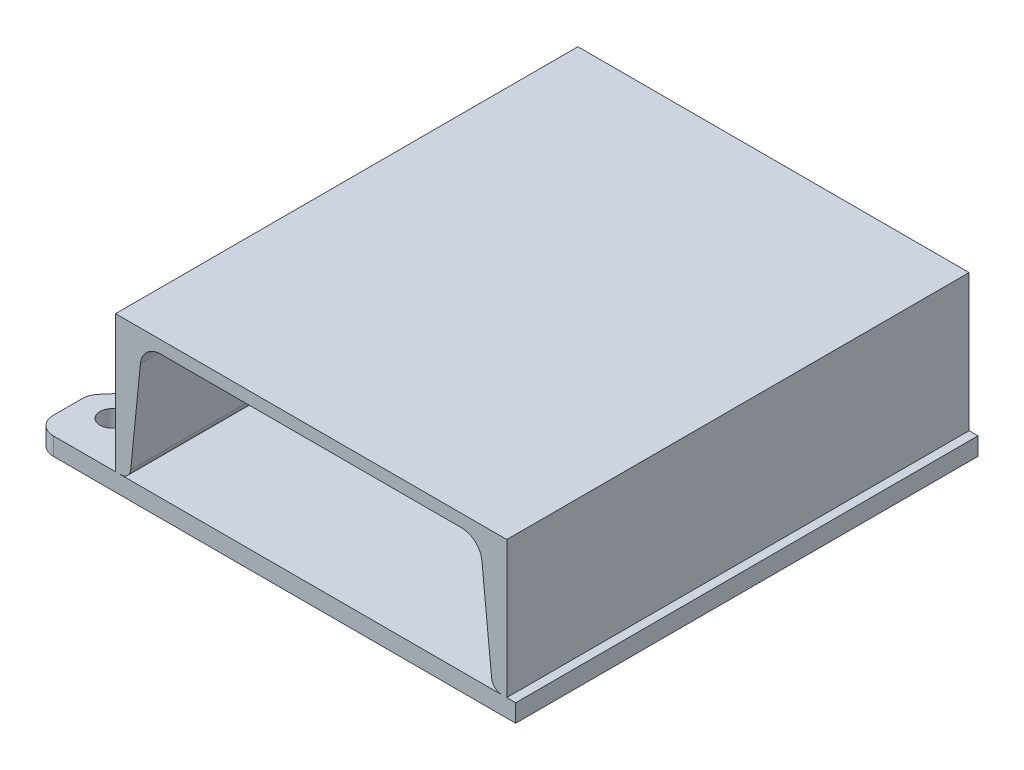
ISO-10303-21;
HEADER;
FILE_DESCRIPTION(('STEP AP214'),'2;1');
FILE_NAME('part.step','',(''),(''),'','','');
FILE_SCHEMA(('AUTOMOTIVE_DESIGN { 1 0 10303 214 1 1 1 1 }'));
ENDSEC;
DATA;
#1=APPLICATION_CONTEXT('core data for automotive mechanical design processes');
#2=APPLICATION_PROTOCOL_DEFINITION('international standard','automotive_design',2000,#1);
#3=PRODUCT_CONTEXT('',#1,'mechanical');
#4=PRODUCT('Part','Part','',(#3));
#5=PRODUCT_RELATED_PRODUCT_CATEGORY('part','',(#4));
#6=PRODUCT_DEFINITION_FORMATION('','',#4);
#7=PRODUCT_DEFINITION_CONTEXT('part definition',#1,'design');
#8=PRODUCT_DEFINITION('design','',#6,#7);
#9=PRODUCT_DEFINITION_SHAPE('','',#8);
#10=(LENGTH_UNIT() NAMED_UNIT(*) SI_UNIT(.MILLI.,.METRE.));
#11=(NAMED_UNIT(*) PLANE_ANGLE_UNIT() SI_UNIT($,.RADIAN.));
#12=(NAMED_UNIT(*) SI_UNIT($,.STERADIAN.) SOLID_ANGLE_UNIT());
#13=UNCERTAINTY_MEASURE_WITH_UNIT(LENGTH_MEASURE(1.E-05),#10,'distance_accuracy_value','');
#14=(GEOMETRIC_REPRESENTATION_CONTEXT(3) GLOBAL_UNCERTAINTY_ASSIGNED_CONTEXT((#13)) GLOBAL_UNIT_ASSIGNED_CONTEXT((#10,
#11,#12)) REPRESENTATION_CONTEXT('',''));
#15=CARTESIAN_POINT('',(0.,0.,0.));
#16=DIRECTION('',(0.,0.,1.));
#17=DIRECTION('',(1.,0.,0.));
#18=AXIS2_PLACEMENT_3D('',#15,#16,#17);
#19=CARTESIAN_POINT('',(-270.,10.,-130.));
#20=DIRECTION('',(0.,1.,0.));
#21=DIRECTION('',(0.,0.,1.));
#22=AXIS2_PLACEMENT_3D('',#19,#20,#21);
#23=PLANE('',#22);
#24=CARTESIAN_POINT('',(-252.,10.,105.));
#25=DIRECTION('',(0.,1.,0.));
#26=DIRECTION('',(0.,0.,1.));
#27=AXIS2_PLACEMENT_3D('',#24,#25,#26);
#28=CIRCLE('',#27,6.75);
#29=CARTESIAN_POINT('',(-252.,10.,111.75));
#30=VERTEX_POINT('',#29);
#31=EDGE_CURVE('E416',#30,#30,#28,.T.);
#32=ORIENTED_EDGE('',*,*,#31,.F.);
#33=EDGE_LOOP('',(#32));
#34=FACE_BOUND('',#33,.T.);
#35=CARTESIAN_POINT('',(-252.,10.,-105.));
#36=DIRECTION('',(0.,1.,0.));
#37=DIRECTION('',(0.,0.,1.));
#38=AXIS2_PLACEMENT_3D('',#35,#36,#37);
#39=CIRCLE('',#38,6.75);
#40=CARTESIAN_POINT('',(-252.,10.,-98.25));
#41=VERTEX_POINT('',#40);
#42=EDGE_CURVE('E250',#41,#41,#39,.T.);
#43=ORIENTED_EDGE('',*,*,#42,.F.);
#44=EDGE_LOOP('',(#43));
#45=FACE_BOUND('',#44,.T.);
#46=DIRECTION('',(1.,0.,0.));
#47=VECTOR('',#46,1.);
#48=CARTESIAN_POINT('',(0.,10.,130.));
#49=LINE('',#48,#47);
#50=CARTESIAN_POINT('',(-260.,10.,130.));
#51=VERTEX_POINT('',#50);
#52=CARTESIAN_POINT('',(-225.,10.,130.));
#53=VERTEX_POINT('',#52);
#54=EDGE_CURVE('E204',#51,#53,#49,.T.);
#55=ORIENTED_EDGE('',*,*,#54,.T.);
#56=DIRECTION('',(0.,0.,1.));
#57=VECTOR('',#56,1.);
#58=CARTESIAN_POINT('',(-225.,10.,-130.));
#59=LINE('',#58,#57);
#60=CARTESIAN_POINT('',(-225.,10.,-130.));
#61=VERTEX_POINT('',#60);
#62=EDGE_CURVE('E192',#61,#53,#59,.T.);
#63=ORIENTED_EDGE('',*,*,#62,.F.);
#64=DIRECTION('',(-1.,0.,0.));
#65=VECTOR('',#64,1.);
#66=CARTESIAN_POINT('',(0.,10.,-130.));
#67=LINE('',#66,#65);
#68=CARTESIAN_POINT('',(-260.,10.,-130.));
#69=VERTEX_POINT('',#68);
#70=EDGE_CURVE('E202',#61,#69,#67,.T.);
#71=ORIENTED_EDGE('',*,*,#70,.T.);
#72=CARTESIAN_POINT('',(-260.,10.,-120.));
#73=DIRECTION('',(0.,1.,0.));
#74=DIRECTION('',(0.,0.,1.));
#75=AXIS2_PLACEMENT_3D('',#72,#73,#74);
#76=CIRCLE('',#75,10.);
#77=CARTESIAN_POINT('',(-270.,10.,-120.));
#78=VERTEX_POINT('',#77);
#79=EDGE_CURVE('E290',#69,#78,#76,.T.);
#80=ORIENTED_EDGE('',*,*,#79,.T.);
#81=DIRECTION('',(0.,0.,1.));
#82=VECTOR('',#81,1.);
#83=CARTESIAN_POINT('',(-270.,10.,-130.));
#84=LINE('',#83,#82);
#85=CARTESIAN_POINT('',(-270.,10.,-103.699240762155));
#86=VERTEX_POINT('',#85);
#87=EDGE_CURVE('E222',#78,#86,#84,.T.);
#88=ORIENTED_EDGE('',*,*,#87,.T.);
#89=CARTESIAN_POINT('',(-260.,10.,-103.699240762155));
#90=DIRECTION('',(0.,1.,0.));
#91=DIRECTION('',(0.,0.,1.));
#92=AXIS2_PLACEMENT_3D('',#89,#90,#91);
#93=CIRCLE('',#92,10.);
#94=CARTESIAN_POINT('',(-267.592566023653,10.,-97.1913270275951));
#95=VERTEX_POINT('',#94);
#96=EDGE_CURVE('E288',#86,#95,#93,.T.);
#97=ORIENTED_EDGE('',*,*,#96,.T.);
#98=DIRECTION('',(0.650791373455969,0.,0.759256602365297));
#99=VECTOR('',#98,1.);
#100=CARTESIAN_POINT('',(-270.,10.,-100.));
#101=LINE('',#100,#99);
#102=CARTESIAN_POINT('',(-242.407433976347,10.,-67.8086729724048));
#103=VERTEX_POINT('',#102);
#104=EDGE_CURVE('E227',#95,#103,#101,.T.);
#105=ORIENTED_EDGE('',*,*,#104,.T.);
#106=CARTESIAN_POINT('',(-250.,10.,-61.3007592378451));
#107=DIRECTION('',(0.,1.,0.));
#108=DIRECTION('',(0.,0.,1.));
#109=AXIS2_PLACEMENT_3D('',#106,#107,#108);
#110=CIRCLE('',#109,10.);
#111=CARTESIAN_POINT('',(-240.,10.,-61.3007592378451));
#112=VERTEX_POINT('',#111);
#113=EDGE_CURVE('E317',#103,#112,#110,.F.);
#114=ORIENTED_EDGE('',*,*,#113,.T.);
#115=DIRECTION('',(0.,0.,1.));
#116=VECTOR('',#115,1.);
#117=CARTESIAN_POINT('',(-240.,10.,-65.));
#118=LINE('',#117,#116);
#119=CARTESIAN_POINT('',(-240.,10.,61.3007592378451));
#120=VERTEX_POINT('',#119);
#121=EDGE_CURVE('E231',#112,#120,#118,.T.);
#122=ORIENTED_EDGE('',*,*,#121,.T.);
#123=CARTESIAN_POINT('',(-250.,10.,61.3007592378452));
#124=DIRECTION('',(0.,1.,0.));
#125=DIRECTION('',(0.,0.,1.));
#126=AXIS2_PLACEMENT_3D('',#123,#124,#125);
#127=CIRCLE('',#126,10.);
#128=CARTESIAN_POINT('',(-242.407433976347,10.,67.8086729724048));
#129=VERTEX_POINT('',#128);
#130=EDGE_CURVE('E10',#120,#129,#127,.F.);
#131=ORIENTED_EDGE('',*,*,#130,.T.);
#132=DIRECTION('',(-0.650791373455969,0.,0.759256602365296));
#133=VECTOR('',#132,1.);
#134=CARTESIAN_POINT('',(-270.,10.,100.));
#135=LINE('',#134,#133);
#136=CARTESIAN_POINT('',(-267.592566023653,10.,97.1913270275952));
#137=VERTEX_POINT('',#136);
#138=EDGE_CURVE('E236',#129,#137,#135,.T.);
#139=ORIENTED_EDGE('',*,*,#138,.T.);
#140=CARTESIAN_POINT('',(-260.,10.,103.699240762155));
#141=DIRECTION('',(0.,1.,0.));
#142=DIRECTION('',(0.,0.,1.));
#143=AXIS2_PLACEMENT_3D('',#140,#141,#142);
#144=CIRCLE('',#143,10.);
#145=CARTESIAN_POINT('',(-270.,10.,103.699240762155));
#146=VERTEX_POINT('',#145);
#147=EDGE_CURVE('E286',#137,#146,#144,.T.);
#148=ORIENTED_EDGE('',*,*,#147,.T.);
#149=DIRECTION('',(0.,0.,1.));
#150=VECTOR('',#149,1.);
#151=CARTESIAN_POINT('',(-270.,10.,130.));
#152=LINE('',#151,#150);
#153=CARTESIAN_POINT('',(-270.,10.,120.));
#154=VERTEX_POINT('',#153);
#155=EDGE_CURVE('E239',#146,#154,#152,.T.);
#156=ORIENTED_EDGE('',*,*,#155,.T.);
#157=CARTESIAN_POINT('',(-260.,10.,120.));
#158=DIRECTION('',(0.,1.,0.));
#159=DIRECTION('',(0.,0.,1.));
#160=AXIS2_PLACEMENT_3D('',#157,#158,#159);
#161=CIRCLE('',#160,10.);
#162=EDGE_CURVE('E38',#154,#51,#161,.T.);
#163=ORIENTED_EDGE('',*,*,#162,.T.);
#164=EDGE_LOOP('',(#55,#63,#71,#80,#88,#97,#105,#114,#122,#131,#139,#148,#156,#163));
#165=FACE_BOUND('',#164,.T.);
#166=ADVANCED_FACE('F15',(#34,#45,#165),#23,.T.);
#167=CARTESIAN_POINT('',(0.,10.,-130.));
#168=VERTEX_POINT('',#167);
#169=CARTESIAN_POINT('',(-5.,10.,-130.));
#170=VERTEX_POINT('',#169);
#171=EDGE_CURVE('E215',#168,#170,#67,.T.);
#172=ORIENTED_EDGE('',*,*,#171,.T.);
#173=DIRECTION('',(0.,0.,1.));
#174=VECTOR('',#173,1.);
#175=CARTESIAN_POINT('',(-5.,10.,-130.));
#176=LINE('',#175,#174);
#177=CARTESIAN_POINT('',(-5.,10.,130.));
#178=VERTEX_POINT('',#177);
#179=EDGE_CURVE('E365',#170,#178,#176,.T.);
#180=ORIENTED_EDGE('',*,*,#179,.T.);
#181=CARTESIAN_POINT('',(0.,10.,130.));
#182=VERTEX_POINT('',#181);
#183=EDGE_CURVE('E241',#178,#182,#49,.T.);
#184=ORIENTED_EDGE('',*,*,#183,.T.);
#185=DIRECTION('',(0.,0.,-1.));
#186=VECTOR('',#185,1.);
#187=CARTESIAN_POINT('',(0.,10.,130.));
#188=LINE('',#187,#186);
#189=EDGE_CURVE('E243',#182,#168,#188,.T.);
#190=ORIENTED_EDGE('',*,*,#189,.T.);
#191=EDGE_LOOP('',(#172,#180,#184,#190));
#192=FACE_BOUND('',#191,.T.);
#193=ADVANCED_FACE('F428',(#192),#23,.T.);
#194=CARTESIAN_POINT('',(-7.7963215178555,10.,-130.));
#195=VERTEX_POINT('',#194);
#196=CARTESIAN_POINT('',(-222.203678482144,10.,-130.));
#197=VERTEX_POINT('',#196);
#198=EDGE_CURVE('E212',#195,#197,#67,.T.);
#199=ORIENTED_EDGE('',*,*,#198,.T.);
#200=DIRECTION('',(0.,0.,1.));
#201=VECTOR('',#200,1.);
#202=CARTESIAN_POINT('',(-222.203678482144,10.,-130.));
#203=LINE('',#202,#201);
#204=CARTESIAN_POINT('',(-222.203678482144,10.,130.));
#205=VERTEX_POINT('',#204);
#206=EDGE_CURVE('E396',#197,#205,#203,.T.);
#207=ORIENTED_EDGE('',*,*,#206,.T.);
#208=CARTESIAN_POINT('',(-7.7963215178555,10.,130.));
#209=VERTEX_POINT('',#208);
#210=EDGE_CURVE('E244',#205,#209,#49,.T.);
#211=ORIENTED_EDGE('',*,*,#210,.T.);
#212=DIRECTION('',(0.,0.,1.));
#213=VECTOR('',#212,1.);
#214=CARTESIAN_POINT('',(-7.7963215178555,10.,-130.));
#215=LINE('',#214,#213);
#216=EDGE_CURVE('E410',#209,#195,#215,.F.);
#217=ORIENTED_EDGE('',*,*,#216,.T.);
#218=EDGE_LOOP('',(#199,#207,#211,#217));
#219=FACE_BOUND('',#218,.T.);
#220=ADVANCED_FACE('F431',(#219),#23,.T.);
#221=CARTESIAN_POINT('',(0.,10.,-130.));
#222=DIRECTION('',(0.,0.,1.));
#223=DIRECTION('',(1.,0.,0.));
#224=AXIS2_PLACEMENT_3D('',#221,#222,#223);
#225=PLANE('',#224);
#226=ORIENTED_EDGE('',*,*,#198,.F.);
#227=CARTESIAN_POINT('',(-7.7963215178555,15.75,-130.));
#228=DIRECTION('',(0.,0.,-1.));
#229=DIRECTION('',(0.,1.,0.));
#230=AXIS2_PLACEMENT_3D('',#227,#228,#229);
#231=CIRCLE('',#230,5.75);
#232=CARTESIAN_POINT('',(-13.5177853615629,15.1778536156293,-130.));
#233=VERTEX_POINT('',#232);
#234=EDGE_CURVE('E403',#195,#233,#231,.T.);
#235=ORIENTED_EDGE('',*,*,#234,.T.);
#236=DIRECTION('',(-0.0995037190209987,0.995037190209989,0.));
#237=VECTOR('',#236,1.);
#238=CARTESIAN_POINT('',(-20.,80.,-130.));
#239=LINE('',#238,#237);
#240=CARTESIAN_POINT('',(-18.9644292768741,69.6442927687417,-130.));
#241=VERTEX_POINT('',#240);
#242=EDGE_CURVE('E655',#233,#241,#239,.T.);
#243=ORIENTED_EDGE('',*,*,#242,.T.);
#244=CARTESIAN_POINT('',(-30.4073569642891,68.5,-130.));
#245=DIRECTION('',(0.,0.,-1.));
#246=DIRECTION('',(0.,1.,0.));
#247=AXIS2_PLACEMENT_3D('',#244,#245,#246);
#248=CIRCLE('',#247,11.5);
#249=CARTESIAN_POINT('',(-30.4073569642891,80.,-130.));
#250=VERTEX_POINT('',#249);
#251=EDGE_CURVE('E394',#241,#250,#248,.F.);
#252=ORIENTED_EDGE('',*,*,#251,.T.);
#253=DIRECTION('',(-1.,0.,0.));
#254=VECTOR('',#253,1.);
#255=CARTESIAN_POINT('',(-210.,80.,-130.));
#256=LINE('',#255,#254);
#257=CARTESIAN_POINT('',(-199.592643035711,80.,-130.));
#258=VERTEX_POINT('',#257);
#259=EDGE_CURVE('E660',#250,#258,#256,.T.);
#260=ORIENTED_EDGE('',*,*,#259,.T.);
#261=CARTESIAN_POINT('',(-199.592643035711,68.5,-130.));
#262=DIRECTION('',(0.,0.,-1.));
#263=DIRECTION('',(0.,1.,0.));
#264=AXIS2_PLACEMENT_3D('',#261,#262,#263);
#265=CIRCLE('',#264,11.5);
#266=CARTESIAN_POINT('',(-211.035570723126,69.6442927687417,-130.));
#267=VERTEX_POINT('',#266);
#268=EDGE_CURVE('E389',#258,#267,#265,.F.);
#269=ORIENTED_EDGE('',*,*,#268,.T.);
#270=DIRECTION('',(-0.0995037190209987,-0.995037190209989,0.));
#271=VECTOR('',#270,1.);
#272=CARTESIAN_POINT('',(-210.,80.,-130.));
#273=LINE('',#272,#271);
#274=CARTESIAN_POINT('',(-216.482214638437,15.1778536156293,-130.));
#275=VERTEX_POINT('',#274);
#276=EDGE_CURVE('E200',#267,#275,#273,.T.);
#277=ORIENTED_EDGE('',*,*,#276,.T.);
#278=CARTESIAN_POINT('',(-222.203678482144,15.75,-130.));
#279=DIRECTION('',(0.,0.,-1.));
#280=DIRECTION('',(0.,1.,0.));
#281=AXIS2_PLACEMENT_3D('',#278,#279,#280);
#282=CIRCLE('',#281,5.75);
#283=EDGE_CURVE('E405',#275,#197,#282,.T.);
#284=ORIENTED_EDGE('',*,*,#283,.T.);
#285=EDGE_LOOP('',(#226,#235,#243,#252,#260,#269,#277,#284));
#286=FACE_BOUND('',#285,.T.);
#287=DIRECTION('',(-1.,0.,0.));
#288=VECTOR('',#287,1.);
#289=CARTESIAN_POINT('',(0.,0.,-130.));
#290=LINE('',#289,#288);
#291=CARTESIAN_POINT('',(0.,0.,-130.));
#292=VERTEX_POINT('',#291);
#293=CARTESIAN_POINT('',(-260.,0.,-130.));
#294=VERTEX_POINT('',#293);
#295=EDGE_CURVE('E247',#292,#294,#290,.T.);
#296=ORIENTED_EDGE('',*,*,#295,.T.);
#297=DIRECTION('',(0.,-1.,0.));
#298=VECTOR('',#297,1.);
#299=CARTESIAN_POINT('',(-260.,10.,-130.));
#300=LINE('',#299,#298);
#301=EDGE_CURVE('E210',#294,#69,#300,.F.);
#302=ORIENTED_EDGE('',*,*,#301,.T.);
#303=ORIENTED_EDGE('',*,*,#70,.F.);
#304=DIRECTION('',(0.,1.,0.));
#305=VECTOR('',#304,1.);
#306=CARTESIAN_POINT('',(-225.,87.,-130.));
#307=LINE('',#306,#305);
#308=CARTESIAN_POINT('',(-225.,87.,-130.));
#309=VERTEX_POINT('',#308);
#310=EDGE_CURVE('E189',#61,#309,#307,.T.);
#311=ORIENTED_EDGE('',*,*,#310,.T.);
#312=DIRECTION('',(1.,0.,0.));
#313=VECTOR('',#312,1.);
#314=CARTESIAN_POINT('',(-5.,87.,-130.));
#315=LINE('',#314,#313);
#316=CARTESIAN_POINT('',(-5.,87.,-130.));
#317=VERTEX_POINT('',#316);
#318=EDGE_CURVE('E199',#309,#317,#315,.T.);
#319=ORIENTED_EDGE('',*,*,#318,.T.);
#320=DIRECTION('',(0.,-1.,0.));
#321=VECTOR('',#320,1.);
#322=CARTESIAN_POINT('',(-5.,87.,-130.));
#323=LINE('',#322,#321);
#324=EDGE_CURVE('E360',#317,#170,#323,.T.);
#325=ORIENTED_EDGE('',*,*,#324,.T.);
#326=ORIENTED_EDGE('',*,*,#171,.F.);
#327=DIRECTION('',(0.,-1.,0.));
#328=VECTOR('',#327,1.);
#329=CARTESIAN_POINT('',(0.,10.,-130.));
#330=LINE('',#329,#328);
#331=EDGE_CURVE('E246',#168,#292,#330,.T.);
#332=ORIENTED_EDGE('',*,*,#331,.T.);
#333=EDGE_LOOP('',(#296,#302,#303,#311,#319,#325,#326,#332));
#334=FACE_BOUND('',#333,.T.);
#335=ADVANCED_FACE('F208',(#286,#334),#225,.F.);
#336=CARTESIAN_POINT('',(-270.,10.,-130.));
#337=DIRECTION('',(1.,0.,0.));
#338=DIRECTION('',(0.,0.,-1.));
#339=AXIS2_PLACEMENT_3D('',#336,#337,#338);
#340=PLANE('',#339);
#341=ORIENTED_EDGE('',*,*,#87,.F.);
#342=DIRECTION('',(0.,-1.,0.));
#343=VECTOR('',#342,1.);
#344=CARTESIAN_POINT('',(-270.,10.,-120.));
#345=LINE('',#344,#343);
#346=CARTESIAN_POINT('',(-270.,0.,-120.));
#347=VERTEX_POINT('',#346);
#348=EDGE_CURVE('E273',#78,#347,#345,.T.);
#349=ORIENTED_EDGE('',*,*,#348,.T.);
#350=DIRECTION('',(0.,0.,1.));
#351=VECTOR('',#350,1.);
#352=CARTESIAN_POINT('',(-270.,0.,-130.));
#353=LINE('',#352,#351);
#354=CARTESIAN_POINT('',(-270.,0.,-103.699240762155));
#355=VERTEX_POINT('',#354);
#356=EDGE_CURVE('E249',#347,#355,#353,.T.);
#357=ORIENTED_EDGE('',*,*,#356,.T.);
#358=DIRECTION('',(0.,-1.,0.));
#359=VECTOR('',#358,1.);
#360=CARTESIAN_POINT('',(-270.,10.,-103.699240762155));
#361=LINE('',#360,#359);
#362=EDGE_CURVE('E271',#355,#86,#361,.F.);
#363=ORIENTED_EDGE('',*,*,#362,.T.);
#364=EDGE_LOOP('',(#341,#349,#357,#363));
#365=FACE_BOUND('',#364,.T.);
#366=ADVANCED_FACE('F446',(#365),#340,.F.);
#367=CARTESIAN_POINT('',(-270.,10.,-100.));
#368=DIRECTION('',(0.759256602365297,0.,-0.650791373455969));
#369=DIRECTION('',(-0.650791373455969,0.,-0.759256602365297));
#370=AXIS2_PLACEMENT_3D('',#367,#368,#369);
#371=PLANE('',#370);
#372=ORIENTED_EDGE('',*,*,#104,.F.);
#373=DIRECTION('',(0.,-1.,0.));
#374=VECTOR('',#373,1.);
#375=CARTESIAN_POINT('',(-267.592566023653,10.,-97.1913270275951));
#376=LINE('',#375,#374);
#377=CARTESIAN_POINT('',(-267.592566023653,0.,-97.1913270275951));
#378=VERTEX_POINT('',#377);
#379=EDGE_CURVE('E294',#95,#378,#376,.T.);
#380=ORIENTED_EDGE('',*,*,#379,.T.);
#381=DIRECTION('',(0.650791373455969,0.,0.759256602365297));
#382=VECTOR('',#381,1.);
#383=CARTESIAN_POINT('',(-270.,0.,-100.));
#384=LINE('',#383,#382);
#385=CARTESIAN_POINT('',(-242.407433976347,0.,-67.8086729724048));
#386=VERTEX_POINT('',#385);
#387=EDGE_CURVE('E253',#378,#386,#384,.T.);
#388=ORIENTED_EDGE('',*,*,#387,.T.);
#389=DIRECTION('',(0.,-1.,0.));
#390=VECTOR('',#389,1.);
#391=CARTESIAN_POINT('',(-242.407433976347,10.,-67.8086729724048));
#392=LINE('',#391,#390);
#393=EDGE_CURVE('E292',#386,#103,#392,.F.);
#394=ORIENTED_EDGE('',*,*,#393,.T.);
#395=EDGE_LOOP('',(#372,#380,#388,#394));
#396=FACE_BOUND('',#395,.T.);
#397=ADVANCED_FACE('F507',(#396),#371,.F.);
#398=CARTESIAN_POINT('',(-240.,10.,-65.));
#399=DIRECTION('',(1.,0.,0.));
#400=DIRECTION('',(0.,0.,-1.));
#401=AXIS2_PLACEMENT_3D('',#398,#399,#400);
#402=PLANE('',#401);
#403=ORIENTED_EDGE('',*,*,#121,.F.);
#404=DIRECTION('',(0.,-1.,0.));
#405=VECTOR('',#404,1.);
#406=CARTESIAN_POINT('',(-240.,0.,-61.3007592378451));
#407=LINE('',#406,#405);
#408=CARTESIAN_POINT('',(-240.,0.,-61.3007592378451));
#409=VERTEX_POINT('',#408);
#410=EDGE_CURVE('E299',#112,#409,#407,.T.);
#411=ORIENTED_EDGE('',*,*,#410,.T.);
#412=DIRECTION('',(0.,0.,1.));
#413=VECTOR('',#412,1.);
#414=CARTESIAN_POINT('',(-240.,0.,-65.));
#415=LINE('',#414,#413);
#416=CARTESIAN_POINT('',(-240.,0.,61.3007592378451));
#417=VERTEX_POINT('',#416);
#418=EDGE_CURVE('E256',#409,#417,#415,.T.);
#419=ORIENTED_EDGE('',*,*,#418,.T.);
#420=DIRECTION('',(0.,-1.,0.));
#421=VECTOR('',#420,1.);
#422=CARTESIAN_POINT('',(-240.,10.,61.3007592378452));
#423=LINE('',#422,#421);
#424=EDGE_CURVE('E297',#417,#120,#423,.F.);
#425=ORIENTED_EDGE('',*,*,#424,.T.);
#426=EDGE_LOOP('',(#403,#411,#419,#425));
#427=FACE_BOUND('',#426,.T.);
#428=ADVANCED_FACE('F328',(#427),#402,.F.);
#429=CARTESIAN_POINT('',(-270.,10.,100.));
#430=DIRECTION('',(0.759256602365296,0.,0.650791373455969));
#431=DIRECTION('',(0.650791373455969,0.,-0.759256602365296));
#432=AXIS2_PLACEMENT_3D('',#429,#430,#431);
#433=PLANE('',#432);
#434=ORIENTED_EDGE('',*,*,#138,.F.);
#435=DIRECTION('',(0.,-1.,0.));
#436=VECTOR('',#435,1.);
#437=CARTESIAN_POINT('',(-242.407433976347,0.,67.8086729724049));
#438=LINE('',#437,#436);
#439=CARTESIAN_POINT('',(-242.407433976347,0.,67.8086729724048));
#440=VERTEX_POINT('',#439);
#441=EDGE_CURVE('E304',#129,#440,#438,.T.);
#442=ORIENTED_EDGE('',*,*,#441,.T.);
#443=DIRECTION('',(-0.650791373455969,0.,0.759256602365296));
#444=VECTOR('',#443,1.);
#445=CARTESIAN_POINT('',(-270.,0.,100.));
#446=LINE('',#445,#444);
#447=CARTESIAN_POINT('',(-267.592566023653,0.,97.1913270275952));
#448=VERTEX_POINT('',#447);
#449=EDGE_CURVE('E259',#440,#448,#446,.T.);
#450=ORIENTED_EDGE('',*,*,#449,.T.);
#451=DIRECTION('',(0.,-1.,0.));
#452=VECTOR('',#451,1.);
#453=CARTESIAN_POINT('',(-267.592566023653,10.,97.1913270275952));
#454=LINE('',#453,#452);
#455=EDGE_CURVE('E302',#448,#137,#454,.F.);
#456=ORIENTED_EDGE('',*,*,#455,.T.);
#457=EDGE_LOOP('',(#434,#442,#450,#456));
#458=FACE_BOUND('',#457,.T.);
#459=ADVANCED_FACE('F335',(#458),#433,.F.);
#460=CARTESIAN_POINT('',(-270.,10.,130.));
#461=DIRECTION('',(1.,0.,0.));
#462=DIRECTION('',(0.,0.,-1.));
#463=AXIS2_PLACEMENT_3D('',#460,#461,#462);
#464=PLANE('',#463);
#465=ORIENTED_EDGE('',*,*,#155,.F.);
#466=DIRECTION('',(0.,-1.,0.));
#467=VECTOR('',#466,1.);
#468=CARTESIAN_POINT('',(-270.,10.,103.699240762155));
#469=LINE('',#468,#467);
#470=CARTESIAN_POINT('',(-270.,0.,103.699240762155));
#471=VERTEX_POINT('',#470);
#472=EDGE_CURVE('E309',#146,#471,#469,.T.);
#473=ORIENTED_EDGE('',*,*,#472,.T.);
#474=DIRECTION('',(0.,0.,1.));
#475=VECTOR('',#474,1.);
#476=CARTESIAN_POINT('',(-270.,0.,130.));
#477=LINE('',#476,#475);
#478=CARTESIAN_POINT('',(-270.,0.,120.));
#479=VERTEX_POINT('',#478);
#480=EDGE_CURVE('E262',#471,#479,#477,.T.);
#481=ORIENTED_EDGE('',*,*,#480,.T.);
#482=DIRECTION('',(0.,-1.,0.));
#483=VECTOR('',#482,1.);
#484=CARTESIAN_POINT('',(-270.,10.,120.));
#485=LINE('',#484,#483);
#486=EDGE_CURVE('E307',#479,#154,#485,.F.);
#487=ORIENTED_EDGE('',*,*,#486,.T.);
#488=EDGE_LOOP('',(#465,#473,#481,#487));
#489=FACE_BOUND('',#488,.T.);
#490=ADVANCED_FACE('F342',(#489),#464,.F.);
#491=CARTESIAN_POINT('',(0.,10.,130.));
#492=DIRECTION('',(0.,0.,-1.));
#493=DIRECTION('',(-1.,0.,0.));
#494=AXIS2_PLACEMENT_3D('',#491,#492,#493);
#495=PLANE('',#494);
#496=ORIENTED_EDGE('',*,*,#183,.F.);
#497=DIRECTION('',(0.,-1.,0.));
#498=VECTOR('',#497,1.);
#499=CARTESIAN_POINT('',(-5.,87.,130.));
#500=LINE('',#499,#498);
#501=CARTESIAN_POINT('',(-5.,87.,130.));
#502=VERTEX_POINT('',#501);
#503=EDGE_CURVE('E369',#502,#178,#500,.T.);
#504=ORIENTED_EDGE('',*,*,#503,.F.);
#505=DIRECTION('',(1.,0.,0.));
#506=VECTOR('',#505,1.);
#507=CARTESIAN_POINT('',(-5.,87.,130.));
#508=LINE('',#507,#506);
#509=CARTESIAN_POINT('',(-225.,87.,130.));
#510=VERTEX_POINT('',#509);
#511=EDGE_CURVE('E674',#510,#502,#508,.T.);
#512=ORIENTED_EDGE('',*,*,#511,.F.);
#513=DIRECTION('',(0.,1.,0.));
#514=VECTOR('',#513,1.);
#515=CARTESIAN_POINT('',(-225.,87.,130.));
#516=LINE('',#515,#514);
#517=EDGE_CURVE('E673',#53,#510,#516,.T.);
#518=ORIENTED_EDGE('',*,*,#517,.F.);
#519=ORIENTED_EDGE('',*,*,#54,.F.);
#520=DIRECTION('',(0.,-1.,0.));
#521=VECTOR('',#520,1.);
#522=CARTESIAN_POINT('',(-260.,10.,130.));
#523=LINE('',#522,#521);
#524=CARTESIAN_POINT('',(-260.,0.,130.));
#525=VERTEX_POINT('',#524);
#526=EDGE_CURVE('E312',#51,#525,#523,.T.);
#527=ORIENTED_EDGE('',*,*,#526,.T.);
#528=DIRECTION('',(1.,0.,0.));
#529=VECTOR('',#528,1.);
#530=CARTESIAN_POINT('',(0.,0.,130.));
#531=LINE('',#530,#529);
#532=CARTESIAN_POINT('',(0.,0.,130.));
#533=VERTEX_POINT('',#532);
#534=EDGE_CURVE('E217',#525,#533,#531,.T.);
#535=ORIENTED_EDGE('',*,*,#534,.T.);
#536=DIRECTION('',(0.,-1.,0.));
#537=VECTOR('',#536,1.);
#538=CARTESIAN_POINT('',(0.,10.,130.));
#539=LINE('',#538,#537);
#540=EDGE_CURVE('E268',#182,#533,#539,.T.);
#541=ORIENTED_EDGE('',*,*,#540,.F.);
#542=EDGE_LOOP('',(#496,#504,#512,#518,#519,#527,#535,#541));
#543=FACE_BOUND('',#542,.T.);
#544=CARTESIAN_POINT('',(-7.7963215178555,15.75,130.));
#545=DIRECTION('',(0.,0.,-1.));
#546=DIRECTION('',(0.,1.,0.));
#547=AXIS2_PLACEMENT_3D('',#544,#545,#546);
#548=CIRCLE('',#547,5.75);
#549=CARTESIAN_POINT('',(-13.5177853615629,15.1778536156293,130.));
#550=VERTEX_POINT('',#549);
#551=EDGE_CURVE('E398',#550,#209,#548,.F.);
#552=ORIENTED_EDGE('',*,*,#551,.T.);
#553=ORIENTED_EDGE('',*,*,#210,.F.);
#554=CARTESIAN_POINT('',(-222.203678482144,15.75,130.));
#555=DIRECTION('',(0.,0.,-1.));
#556=DIRECTION('',(0.,1.,0.));
#557=AXIS2_PLACEMENT_3D('',#554,#555,#556);
#558=CIRCLE('',#557,5.75);
#559=CARTESIAN_POINT('',(-216.482214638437,15.1778536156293,130.));
#560=VERTEX_POINT('',#559);
#561=EDGE_CURVE('E30',#205,#560,#558,.F.);
#562=ORIENTED_EDGE('',*,*,#561,.T.);
#563=DIRECTION('',(-0.0995037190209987,-0.995037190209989,0.));
#564=VECTOR('',#563,1.);
#565=CARTESIAN_POINT('',(-210.,80.,130.));
#566=LINE('',#565,#564);
#567=CARTESIAN_POINT('',(-211.035570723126,69.6442927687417,130.));
#568=VERTEX_POINT('',#567);
#569=EDGE_CURVE('E667',#568,#560,#566,.T.);
#570=ORIENTED_EDGE('',*,*,#569,.F.);
#571=CARTESIAN_POINT('',(-199.592643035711,68.5,130.));
#572=DIRECTION('',(0.,0.,-1.));
#573=DIRECTION('',(0.,1.,0.));
#574=AXIS2_PLACEMENT_3D('',#571,#572,#573);
#575=CIRCLE('',#574,11.5);
#576=CARTESIAN_POINT('',(-199.592643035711,80.,130.));
#577=VERTEX_POINT('',#576);
#578=EDGE_CURVE('E387',#568,#577,#575,.T.);
#579=ORIENTED_EDGE('',*,*,#578,.T.);
#580=DIRECTION('',(-1.,0.,0.));
#581=VECTOR('',#580,1.);
#582=CARTESIAN_POINT('',(-210.,80.,130.));
#583=LINE('',#582,#581);
#584=CARTESIAN_POINT('',(-30.4073569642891,80.,130.));
#585=VERTEX_POINT('',#584);
#586=EDGE_CURVE('E664',#585,#577,#583,.T.);
#587=ORIENTED_EDGE('',*,*,#586,.F.);
#588=CARTESIAN_POINT('',(-30.4073569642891,68.5,130.));
#589=DIRECTION('',(0.,0.,-1.));
#590=DIRECTION('',(0.,1.,0.));
#591=AXIS2_PLACEMENT_3D('',#588,#589,#590);
#592=CIRCLE('',#591,11.5);
#593=CARTESIAN_POINT('',(-18.9644292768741,69.6442927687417,130.));
#594=VERTEX_POINT('',#593);
#595=EDGE_CURVE('E391',#585,#594,#592,.T.);
#596=ORIENTED_EDGE('',*,*,#595,.T.);
#597=DIRECTION('',(-0.0995037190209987,0.995037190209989,0.));
#598=VECTOR('',#597,1.);
#599=CARTESIAN_POINT('',(-20.,80.,130.));
#600=LINE('',#599,#598);
#601=EDGE_CURVE('E662',#550,#594,#600,.T.);
#602=ORIENTED_EDGE('',*,*,#601,.F.);
#603=EDGE_LOOP('',(#552,#553,#562,#570,#579,#587,#596,#602));
#604=FACE_BOUND('',#603,.T.);
#605=ADVANCED_FACE('F350',(#543,#604),#495,.F.);
#606=CARTESIAN_POINT('',(0.,10.,130.));
#607=DIRECTION('',(-1.,0.,0.));
#608=DIRECTION('',(0.,0.,1.));
#609=AXIS2_PLACEMENT_3D('',#606,#607,#608);
#610=PLANE('',#609);
#611=DIRECTION('',(0.,0.,-1.));
#612=VECTOR('',#611,1.);
#613=CARTESIAN_POINT('',(0.,0.,130.));
#614=LINE('',#613,#612);
#615=EDGE_CURVE('E213',#533,#292,#614,.T.);
#616=ORIENTED_EDGE('',*,*,#615,.T.);
#617=ORIENTED_EDGE('',*,*,#331,.F.);
#618=ORIENTED_EDGE('',*,*,#189,.F.);
#619=ORIENTED_EDGE('',*,*,#540,.T.);
#620=EDGE_LOOP('',(#616,#617,#618,#619));
#621=FACE_BOUND('',#620,.T.);
#622=ADVANCED_FACE('F357',(#621),#610,.F.);
#623=CARTESIAN_POINT('',(-270.,0.,-130.));
#624=DIRECTION('',(0.,1.,0.));
#625=DIRECTION('',(0.,0.,1.));
#626=AXIS2_PLACEMENT_3D('',#623,#624,#625);
#627=PLANE('',#626);
#628=CARTESIAN_POINT('',(-252.,0.,105.));
#629=DIRECTION('',(0.,-1.,0.));
#630=DIRECTION('',(0.,0.,-1.));
#631=AXIS2_PLACEMENT_3D('',#628,#629,#630);
#632=CIRCLE('',#631,6.75);
#633=CARTESIAN_POINT('',(-252.,0.,98.25));
#634=VERTEX_POINT('',#633);
#635=EDGE_CURVE('E413',#634,#634,#632,.T.);
#636=ORIENTED_EDGE('',*,*,#635,.F.);
#637=EDGE_LOOP('',(#636));
#638=FACE_BOUND('',#637,.T.);
#639=CARTESIAN_POINT('',(-252.,0.,-105.));
#640=DIRECTION('',(0.,-1.,0.));
#641=DIRECTION('',(0.,0.,-1.));
#642=AXIS2_PLACEMENT_3D('',#639,#640,#641);
#643=CIRCLE('',#642,6.75);
#644=CARTESIAN_POINT('',(-252.,0.,-111.75));
#645=VERTEX_POINT('',#644);
#646=EDGE_CURVE('E419',#645,#645,#643,.T.);
#647=ORIENTED_EDGE('',*,*,#646,.F.);
#648=EDGE_LOOP('',(#647));
#649=FACE_BOUND('',#648,.T.);
#650=ORIENTED_EDGE('',*,*,#356,.F.);
#651=CARTESIAN_POINT('',(-260.,0.,-120.));
#652=DIRECTION('',(0.,1.,0.));
#653=DIRECTION('',(0.,0.,1.));
#654=AXIS2_PLACEMENT_3D('',#651,#652,#653);
#655=CIRCLE('',#654,10.);
#656=EDGE_CURVE('E282',#347,#294,#655,.F.);
#657=ORIENTED_EDGE('',*,*,#656,.T.);
#658=ORIENTED_EDGE('',*,*,#295,.F.);
#659=ORIENTED_EDGE('',*,*,#615,.F.);
#660=ORIENTED_EDGE('',*,*,#534,.F.);
#661=CARTESIAN_POINT('',(-260.,0.,120.));
#662=DIRECTION('',(0.,1.,0.));
#663=DIRECTION('',(0.,0.,1.));
#664=AXIS2_PLACEMENT_3D('',#661,#662,#663);
#665=CIRCLE('',#664,10.);
#666=EDGE_CURVE('E276',#525,#479,#665,.F.);
#667=ORIENTED_EDGE('',*,*,#666,.T.);
#668=ORIENTED_EDGE('',*,*,#480,.F.);
#669=CARTESIAN_POINT('',(-260.,0.,103.699240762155));
#670=DIRECTION('',(0.,1.,0.));
#671=DIRECTION('',(0.,0.,1.));
#672=AXIS2_PLACEMENT_3D('',#669,#670,#671);
#673=CIRCLE('',#672,10.);
#674=EDGE_CURVE('E278',#471,#448,#673,.F.);
#675=ORIENTED_EDGE('',*,*,#674,.T.);
#676=ORIENTED_EDGE('',*,*,#449,.F.);
#677=CARTESIAN_POINT('',(-250.,0.,61.3007592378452));
#678=DIRECTION('',(0.,1.,0.));
#679=DIRECTION('',(0.,0.,1.));
#680=AXIS2_PLACEMENT_3D('',#677,#678,#679);
#681=CIRCLE('',#680,10.);
#682=EDGE_CURVE('E23',#440,#417,#681,.T.);
#683=ORIENTED_EDGE('',*,*,#682,.T.);
#684=ORIENTED_EDGE('',*,*,#418,.F.);
#685=CARTESIAN_POINT('',(-250.,0.,-61.3007592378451));
#686=DIRECTION('',(0.,1.,0.));
#687=DIRECTION('',(0.,0.,1.));
#688=AXIS2_PLACEMENT_3D('',#685,#686,#687);
#689=CIRCLE('',#688,10.);
#690=EDGE_CURVE('E315',#409,#386,#689,.T.);
#691=ORIENTED_EDGE('',*,*,#690,.T.);
#692=ORIENTED_EDGE('',*,*,#387,.F.);
#693=CARTESIAN_POINT('',(-260.,0.,-103.699240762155));
#694=DIRECTION('',(0.,1.,0.));
#695=DIRECTION('',(0.,0.,1.));
#696=AXIS2_PLACEMENT_3D('',#693,#694,#695);
#697=CIRCLE('',#696,10.);
#698=EDGE_CURVE('E280',#378,#355,#697,.F.);
#699=ORIENTED_EDGE('',*,*,#698,.T.);
#700=EDGE_LOOP('',(#650,#657,#658,#659,#660,#667,#668,#675,#676,#683,#684,#691,#692,#699));
#701=FACE_BOUND('',#700,.T.);
#702=ADVANCED_FACE('F322',(#638,#649,#701),#627,.F.);
#703=CARTESIAN_POINT('',(-260.,10.,-120.));
#704=DIRECTION('',(0.,-1.,0.));
#705=DIRECTION('',(0.,0.,-1.));
#706=AXIS2_PLACEMENT_3D('',#703,#704,#705);
#707=CYLINDRICAL_SURFACE('',#706,10.);
#708=ORIENTED_EDGE('',*,*,#79,.F.);
#709=ORIENTED_EDGE('',*,*,#301,.F.);
#710=ORIENTED_EDGE('',*,*,#656,.F.);
#711=ORIENTED_EDGE('',*,*,#348,.F.);
#712=EDGE_LOOP('',(#708,#709,#710,#711));
#713=FACE_BOUND('',#712,.T.);
#714=ADVANCED_FACE('F500',(#713),#707,.T.);
#715=CARTESIAN_POINT('',(-260.,10.,-103.699240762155));
#716=DIRECTION('',(0.,-1.,0.));
#717=DIRECTION('',(0.,0.,-1.));
#718=AXIS2_PLACEMENT_3D('',#715,#716,#717);
#719=CYLINDRICAL_SURFACE('',#718,10.);
#720=ORIENTED_EDGE('',*,*,#96,.F.);
#721=ORIENTED_EDGE('',*,*,#362,.F.);
#722=ORIENTED_EDGE('',*,*,#698,.F.);
#723=ORIENTED_EDGE('',*,*,#379,.F.);
#724=EDGE_LOOP('',(#720,#721,#722,#723));
#725=FACE_BOUND('',#724,.T.);
#726=ADVANCED_FACE('F496',(#725),#719,.T.);
#727=CARTESIAN_POINT('',(-250.,10.,-61.3007592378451));
#728=DIRECTION('',(0.,1.,0.));
#729=DIRECTION('',(0.,0.,1.));
#730=AXIS2_PLACEMENT_3D('',#727,#728,#729);
#731=CYLINDRICAL_SURFACE('',#730,10.);
#732=ORIENTED_EDGE('',*,*,#113,.F.);
#733=ORIENTED_EDGE('',*,*,#393,.F.);
#734=ORIENTED_EDGE('',*,*,#690,.F.);
#735=ORIENTED_EDGE('',*,*,#410,.F.);
#736=EDGE_LOOP('',(#732,#733,#734,#735));
#737=FACE_BOUND('',#736,.T.);
#738=ADVANCED_FACE('F491',(#737),#731,.F.);
#739=CARTESIAN_POINT('',(-250.,10.,61.3007592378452));
#740=DIRECTION('',(0.,1.,0.));
#741=DIRECTION('',(0.,0.,1.));
#742=AXIS2_PLACEMENT_3D('',#739,#740,#741);
#743=CYLINDRICAL_SURFACE('',#742,10.);
#744=ORIENTED_EDGE('',*,*,#130,.F.);
#745=ORIENTED_EDGE('',*,*,#424,.F.);
#746=ORIENTED_EDGE('',*,*,#682,.F.);
#747=ORIENTED_EDGE('',*,*,#441,.F.);
#748=EDGE_LOOP('',(#744,#745,#746,#747));
#749=FACE_BOUND('',#748,.T.);
#750=ADVANCED_FACE('F331',(#749),#743,.F.);
#751=CARTESIAN_POINT('',(-260.,10.,103.699240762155));
#752=DIRECTION('',(0.,-1.,0.));
#753=DIRECTION('',(0.,0.,-1.));
#754=AXIS2_PLACEMENT_3D('',#751,#752,#753);
#755=CYLINDRICAL_SURFACE('',#754,10.);
#756=ORIENTED_EDGE('',*,*,#147,.F.);
#757=ORIENTED_EDGE('',*,*,#455,.F.);
#758=ORIENTED_EDGE('',*,*,#674,.F.);
#759=ORIENTED_EDGE('',*,*,#472,.F.);
#760=EDGE_LOOP('',(#756,#757,#758,#759));
#761=FACE_BOUND('',#760,.T.);
#762=ADVANCED_FACE('F338',(#761),#755,.T.);
#763=CARTESIAN_POINT('',(-260.,10.,120.));
#764=DIRECTION('',(0.,-1.,0.));
#765=DIRECTION('',(0.,0.,-1.));
#766=AXIS2_PLACEMENT_3D('',#763,#764,#765);
#767=CYLINDRICAL_SURFACE('',#766,10.);
#768=ORIENTED_EDGE('',*,*,#162,.F.);
#769=ORIENTED_EDGE('',*,*,#486,.F.);
#770=ORIENTED_EDGE('',*,*,#666,.F.);
#771=ORIENTED_EDGE('',*,*,#526,.F.);
#772=EDGE_LOOP('',(#768,#769,#770,#771));
#773=FACE_BOUND('',#772,.T.);
#774=ADVANCED_FACE('F17',(#773),#767,.T.);
#775=CARTESIAN_POINT('',(-252.,0.,-105.));
#776=DIRECTION('',(0.,-1.,0.));
#777=DIRECTION('',(0.,0.,-1.));
#778=AXIS2_PLACEMENT_3D('',#775,#776,#777);
#779=CYLINDRICAL_SURFACE('',#778,6.75);
#780=ORIENTED_EDGE('',*,*,#42,.T.);
#781=EDGE_LOOP('',(#780));
#782=FACE_BOUND('',#781,.T.);
#783=ORIENTED_EDGE('',*,*,#646,.T.);
#784=EDGE_LOOP('',(#783));
#785=FACE_BOUND('',#784,.T.);
#786=ADVANCED_FACE('F424',(#782,#785),#779,.F.);
#787=CARTESIAN_POINT('',(-252.,0.,105.));
#788=DIRECTION('',(0.,-1.,0.));
#789=DIRECTION('',(0.,0.,-1.));
#790=AXIS2_PLACEMENT_3D('',#787,#788,#789);
#791=CYLINDRICAL_SURFACE('',#790,6.75);
#792=ORIENTED_EDGE('',*,*,#31,.T.);
#793=EDGE_LOOP('',(#792));
#794=FACE_BOUND('',#793,.T.);
#795=ORIENTED_EDGE('',*,*,#635,.T.);
#796=EDGE_LOOP('',(#795));
#797=FACE_BOUND('',#796,.T.);
#798=ADVANCED_FACE('F474',(#794,#797),#791,.F.);
#799=CARTESIAN_POINT('',(-20.,80.,-130.));
#800=DIRECTION('',(0.995037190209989,0.0995037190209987,0.));
#801=DIRECTION('',(0.0995037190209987,-0.995037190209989,0.));
#802=AXIS2_PLACEMENT_3D('',#799,#800,#801);
#803=PLANE('',#802);
#804=ORIENTED_EDGE('',*,*,#242,.F.);
#805=DIRECTION('',(0.,0.,1.));
#806=VECTOR('',#805,1.);
#807=CARTESIAN_POINT('',(-13.5177853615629,15.1778536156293,-130.));
#808=LINE('',#807,#806);
#809=EDGE_CURVE('E407',#233,#550,#808,.T.);
#810=ORIENTED_EDGE('',*,*,#809,.T.);
#811=ORIENTED_EDGE('',*,*,#601,.T.);
#812=DIRECTION('',(0.,0.,1.));
#813=VECTOR('',#812,1.);
#814=CARTESIAN_POINT('',(-18.9644292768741,69.6442927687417,-130.));
#815=LINE('',#814,#813);
#816=EDGE_CURVE('E384',#594,#241,#815,.F.);
#817=ORIENTED_EDGE('',*,*,#816,.T.);
#818=EDGE_LOOP('',(#804,#810,#811,#817));
#819=FACE_BOUND('',#818,.T.);
#820=ADVANCED_FACE('F476',(#819),#803,.F.);
#821=CARTESIAN_POINT('',(-210.,80.,-130.));
#822=DIRECTION('',(0.,1.,0.));
#823=DIRECTION('',(1.,0.,0.));
#824=AXIS2_PLACEMENT_3D('',#821,#822,#823);
#825=PLANE('',#824);
#826=ORIENTED_EDGE('',*,*,#586,.T.);
#827=DIRECTION('',(0.,0.,1.));
#828=VECTOR('',#827,1.);
#829=CARTESIAN_POINT('',(-199.592643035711,80.,-130.));
#830=LINE('',#829,#828);
#831=EDGE_CURVE('E382',#577,#258,#830,.F.);
#832=ORIENTED_EDGE('',*,*,#831,.T.);
#833=ORIENTED_EDGE('',*,*,#259,.F.);
#834=DIRECTION('',(0.,0.,1.));
#835=VECTOR('',#834,1.);
#836=CARTESIAN_POINT('',(-30.4073569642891,80.,130.));
#837=LINE('',#836,#835);
#838=EDGE_CURVE('E379',#250,#585,#837,.T.);
#839=ORIENTED_EDGE('',*,*,#838,.T.);
#840=EDGE_LOOP('',(#826,#832,#833,#839));
#841=FACE_BOUND('',#840,.T.);
#842=ADVANCED_FACE('F640',(#841),#825,.F.);
#843=CARTESIAN_POINT('',(-210.,80.,-130.));
#844=DIRECTION('',(-0.995037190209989,0.0995037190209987,0.));
#845=DIRECTION('',(0.0995037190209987,0.995037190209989,0.));
#846=AXIS2_PLACEMENT_3D('',#843,#844,#845);
#847=PLANE('',#846);
#848=ORIENTED_EDGE('',*,*,#569,.T.);
#849=DIRECTION('',(0.,0.,1.));
#850=VECTOR('',#849,1.);
#851=CARTESIAN_POINT('',(-216.482214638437,15.1778536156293,-130.));
#852=LINE('',#851,#850);
#853=EDGE_CURVE('E401',#560,#275,#852,.F.);
#854=ORIENTED_EDGE('',*,*,#853,.T.);
#855=ORIENTED_EDGE('',*,*,#276,.F.);
#856=DIRECTION('',(0.,0.,1.));
#857=VECTOR('',#856,1.);
#858=CARTESIAN_POINT('',(-211.035570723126,69.6442927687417,130.));
#859=LINE('',#858,#857);
#860=EDGE_CURVE('E205',#267,#568,#859,.T.);
#861=ORIENTED_EDGE('',*,*,#860,.T.);
#862=EDGE_LOOP('',(#848,#854,#855,#861));
#863=FACE_BOUND('',#862,.T.);
#864=ADVANCED_FACE('F633',(#863),#847,.F.);
#865=CARTESIAN_POINT('',(-225.,87.,-130.));
#866=DIRECTION('',(1.,0.,0.));
#867=DIRECTION('',(0.,-1.,0.));
#868=AXIS2_PLACEMENT_3D('',#865,#866,#867);
#869=PLANE('',#868);
#870=ORIENTED_EDGE('',*,*,#517,.T.);
#871=DIRECTION('',(0.,0.,1.));
#872=VECTOR('',#871,1.);
#873=CARTESIAN_POINT('',(-225.,87.,-130.));
#874=LINE('',#873,#872);
#875=EDGE_CURVE('E195',#309,#510,#874,.T.);
#876=ORIENTED_EDGE('',*,*,#875,.F.);
#877=ORIENTED_EDGE('',*,*,#310,.F.);
#878=ORIENTED_EDGE('',*,*,#62,.T.);
#879=EDGE_LOOP('',(#870,#876,#877,#878));
#880=FACE_BOUND('',#879,.T.);
#881=ADVANCED_FACE('F191',(#880),#869,.F.);
#882=CARTESIAN_POINT('',(-5.,87.,-130.));
#883=DIRECTION('',(0.,-1.,0.));
#884=DIRECTION('',(-1.,0.,0.));
#885=AXIS2_PLACEMENT_3D('',#882,#883,#884);
#886=PLANE('',#885);
#887=ORIENTED_EDGE('',*,*,#511,.T.);
#888=DIRECTION('',(0.,0.,1.));
#889=VECTOR('',#888,1.);
#890=CARTESIAN_POINT('',(-5.,87.,-130.));
#891=LINE('',#890,#889);
#892=EDGE_CURVE('E370',#317,#502,#891,.T.);
#893=ORIENTED_EDGE('',*,*,#892,.F.);
#894=ORIENTED_EDGE('',*,*,#318,.F.);
#895=ORIENTED_EDGE('',*,*,#875,.T.);
#896=EDGE_LOOP('',(#887,#893,#894,#895));
#897=FACE_BOUND('',#896,.T.);
#898=ADVANCED_FACE('F619',(#897),#886,.F.);
#899=CARTESIAN_POINT('',(-5.,87.,-130.));
#900=DIRECTION('',(-1.,0.,0.));
#901=DIRECTION('',(0.,1.,0.));
#902=AXIS2_PLACEMENT_3D('',#899,#900,#901);
#903=PLANE('',#902);
#904=ORIENTED_EDGE('',*,*,#503,.T.);
#905=ORIENTED_EDGE('',*,*,#179,.F.);
#906=ORIENTED_EDGE('',*,*,#324,.F.);
#907=ORIENTED_EDGE('',*,*,#892,.T.);
#908=EDGE_LOOP('',(#904,#905,#906,#907));
#909=FACE_BOUND('',#908,.T.);
#910=ADVANCED_FACE('F367',(#909),#903,.F.);
#911=CARTESIAN_POINT('',(-199.592643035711,68.5,-130.));
#912=DIRECTION('',(0.,0.,-1.));
#913=DIRECTION('',(0.,1.,0.));
#914=AXIS2_PLACEMENT_3D('',#911,#912,#913);
#915=CYLINDRICAL_SURFACE('',#914,11.5);
#916=ORIENTED_EDGE('',*,*,#268,.F.);
#917=ORIENTED_EDGE('',*,*,#831,.F.);
#918=ORIENTED_EDGE('',*,*,#578,.F.);
#919=ORIENTED_EDGE('',*,*,#860,.F.);
#920=EDGE_LOOP('',(#916,#917,#918,#919));
#921=FACE_BOUND('',#920,.T.);
#922=ADVANCED_FACE('F469',(#921),#915,.F.);
#923=CARTESIAN_POINT('',(-30.4073569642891,68.5,-130.));
#924=DIRECTION('',(0.,0.,-1.));
#925=DIRECTION('',(0.,1.,0.));
#926=AXIS2_PLACEMENT_3D('',#923,#924,#925);
#927=CYLINDRICAL_SURFACE('',#926,11.5);
#928=ORIENTED_EDGE('',*,*,#251,.F.);
#929=ORIENTED_EDGE('',*,*,#816,.F.);
#930=ORIENTED_EDGE('',*,*,#595,.F.);
#931=ORIENTED_EDGE('',*,*,#838,.F.);
#932=EDGE_LOOP('',(#928,#929,#930,#931));
#933=FACE_BOUND('',#932,.T.);
#934=ADVANCED_FACE('F460',(#933),#927,.F.);
#935=CARTESIAN_POINT('',(-222.203678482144,15.75,-130.));
#936=DIRECTION('',(0.,0.,1.));
#937=DIRECTION('',(0.,-1.,0.));
#938=AXIS2_PLACEMENT_3D('',#935,#936,#937);
#939=CYLINDRICAL_SURFACE('',#938,5.75);
#940=ORIENTED_EDGE('',*,*,#283,.F.);
#941=ORIENTED_EDGE('',*,*,#853,.F.);
#942=ORIENTED_EDGE('',*,*,#561,.F.);
#943=ORIENTED_EDGE('',*,*,#206,.F.);
#944=EDGE_LOOP('',(#940,#941,#942,#943));
#945=FACE_BOUND('',#944,.T.);
#946=ADVANCED_FACE('F457',(#945),#939,.T.);
#947=CARTESIAN_POINT('',(-7.7963215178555,15.75,-130.));
#948=DIRECTION('',(0.,0.,1.));
#949=DIRECTION('',(0.,-1.,0.));
#950=AXIS2_PLACEMENT_3D('',#947,#948,#949);
#951=CYLINDRICAL_SURFACE('',#950,5.75);
#952=ORIENTED_EDGE('',*,*,#234,.F.);
#953=ORIENTED_EDGE('',*,*,#216,.F.);
#954=ORIENTED_EDGE('',*,*,#551,.F.);
#955=ORIENTED_EDGE('',*,*,#809,.F.);
#956=EDGE_LOOP('',(#952,#953,#954,#955));
#957=FACE_BOUND('',#956,.T.);
#958=ADVANCED_FACE('F459',(#957),#951,.T.);
#959=CLOSED_SHELL('',(#166,#193,#220,#335,#366,#397,#428,#459,#490,#605,#622,#702,#714,#726,
#738,#750,#762,#774,#786,#798,#820,#842,#864,#881,#898,#910,#922,#934,#946,#958));
#960=MANIFOLD_SOLID_BREP('B1',#959);
#961=ADVANCED_BREP_SHAPE_REPRESENTATION('',(#18,#960),#14);
#962=SHAPE_DEFINITION_REPRESENTATION(#9,#961);
ENDSEC;
END-ISO-10303-21;
